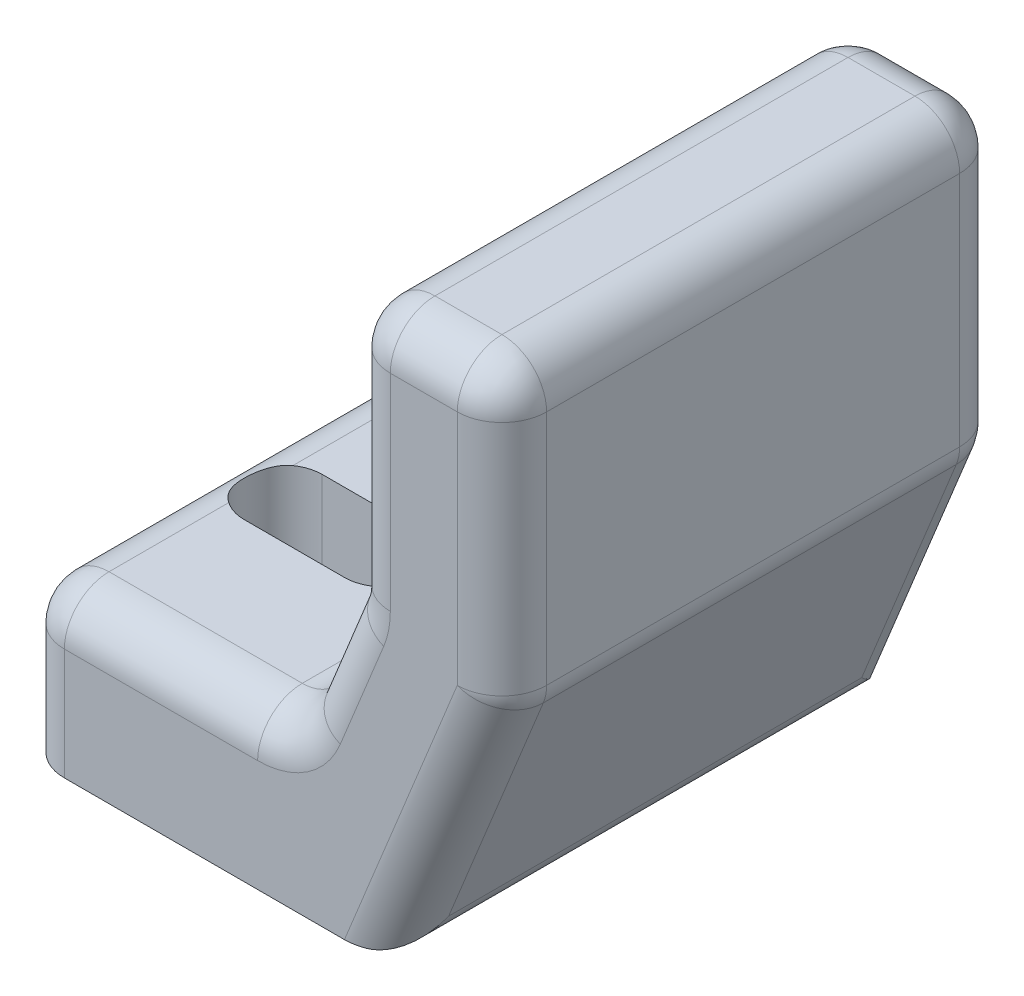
ISO-10303-21;
HEADER;
FILE_DESCRIPTION(('STEP AP214'),'2;1');
FILE_NAME('part.step','',(''),(''),'','','');
FILE_SCHEMA(('AUTOMOTIVE_DESIGN { 1 0 10303 214 1 1 1 1 }'));
ENDSEC;
DATA;
#1=APPLICATION_CONTEXT('core data for automotive mechanical design processes');
#2=APPLICATION_PROTOCOL_DEFINITION('international standard','automotive_design',2000,#1);
#3=PRODUCT_CONTEXT('',#1,'mechanical');
#4=PRODUCT('Part','Part','',(#3));
#5=PRODUCT_RELATED_PRODUCT_CATEGORY('part','',(#4));
#6=PRODUCT_DEFINITION_FORMATION('','',#4);
#7=PRODUCT_DEFINITION_CONTEXT('part definition',#1,'design');
#8=PRODUCT_DEFINITION('design','',#6,#7);
#9=PRODUCT_DEFINITION_SHAPE('','',#8);
#10=(LENGTH_UNIT() NAMED_UNIT(*) SI_UNIT(.MILLI.,.METRE.));
#11=(NAMED_UNIT(*) PLANE_ANGLE_UNIT() SI_UNIT($,.RADIAN.));
#12=(NAMED_UNIT(*) SI_UNIT($,.STERADIAN.) SOLID_ANGLE_UNIT());
#13=UNCERTAINTY_MEASURE_WITH_UNIT(LENGTH_MEASURE(1.E-05),#10,'distance_accuracy_value','');
#14=(GEOMETRIC_REPRESENTATION_CONTEXT(3) GLOBAL_UNCERTAINTY_ASSIGNED_CONTEXT((#13)) GLOBAL_UNIT_ASSIGNED_CONTEXT((#10,
#11,#12)) REPRESENTATION_CONTEXT('',''));
#15=CARTESIAN_POINT('',(0.,0.,0.));
#16=DIRECTION('',(0.,0.,1.));
#17=DIRECTION('',(1.,0.,0.));
#18=AXIS2_PLACEMENT_3D('',#15,#16,#17);
#19=CARTESIAN_POINT('',(0.,7.,22.5));
#20=DIRECTION('',(1.,0.,0.));
#21=DIRECTION('',(0.,1.,0.));
#22=AXIS2_PLACEMENT_3D('',#19,#20,#21);
#23=PLANE('',#22);
#24=DIRECTION('',(0.,0.,-1.));
#25=VECTOR('',#24,1.);
#26=CARTESIAN_POINT('',(0.,0.,22.5));
#27=LINE('',#26,#25);
#28=CARTESIAN_POINT('',(0.,0.,20.5));
#29=VERTEX_POINT('',#28);
#30=CARTESIAN_POINT('',(0.,0.,2.00000000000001));
#31=VERTEX_POINT('',#30);
#32=EDGE_CURVE('E295',#29,#31,#27,.T.);
#33=ORIENTED_EDGE('',*,*,#32,.F.);
#34=DIRECTION('',(0.,-1.,0.));
#35=VECTOR('',#34,1.);
#36=CARTESIAN_POINT('',(0.,7.,20.5));
#37=LINE('',#36,#35);
#38=CARTESIAN_POINT('',(0.,5.,20.5));
#39=VERTEX_POINT('',#38);
#40=EDGE_CURVE('E431',#29,#39,#37,.F.);
#41=ORIENTED_EDGE('',*,*,#40,.T.);
#42=DIRECTION('',(0.,0.,-1.));
#43=VECTOR('',#42,1.);
#44=CARTESIAN_POINT('',(0.,5.,22.5));
#45=LINE('',#44,#43);
#46=CARTESIAN_POINT('',(0.,5.,2.));
#47=VERTEX_POINT('',#46);
#48=EDGE_CURVE('E428',#39,#47,#45,.T.);
#49=ORIENTED_EDGE('',*,*,#48,.T.);
#50=DIRECTION('',(0.,-1.,0.));
#51=VECTOR('',#50,1.);
#52=CARTESIAN_POINT('',(0.,7.,2.));
#53=LINE('',#52,#51);
#54=EDGE_CURVE('E425',#47,#31,#53,.T.);
#55=ORIENTED_EDGE('',*,*,#54,.T.);
#56=EDGE_LOOP('',(#33,#41,#49,#55));
#57=FACE_BOUND('',#56,.T.);
#58=ADVANCED_FACE('F47',(#57),#23,.F.);
#59=CARTESIAN_POINT('',(0.,0.,22.5));
#60=DIRECTION('',(0.,1.,0.));
#61=DIRECTION('',(0.,0.,1.));
#62=AXIS2_PLACEMENT_3D('',#59,#60,#61);
#63=PLANE('',#62);
#64=DIRECTION('',(-1.,0.,0.));
#65=VECTOR('',#64,1.);
#66=CARTESIAN_POINT('',(3.,0.,11.95));
#67=LINE('',#66,#65);
#68=CARTESIAN_POINT('',(7.5,0.,11.95));
#69=VERTEX_POINT('',#68);
#70=CARTESIAN_POINT('',(3.,0.,11.95));
#71=VERTEX_POINT('',#70);
#72=EDGE_CURVE('E781',#69,#71,#67,.T.);
#73=ORIENTED_EDGE('',*,*,#72,.T.);
#74=CARTESIAN_POINT('',(3.,0.,13.7));
#75=DIRECTION('',(0.,1.,0.));
#76=DIRECTION('',(0.,0.,1.));
#77=AXIS2_PLACEMENT_3D('',#74,#75,#76);
#78=CIRCLE('',#77,1.75);
#79=CARTESIAN_POINT('',(3.,0.,15.45));
#80=VERTEX_POINT('',#79);
#81=EDGE_CURVE('E290',#80,#71,#78,.F.);
#82=ORIENTED_EDGE('',*,*,#81,.F.);
#83=DIRECTION('',(-1.,0.,0.));
#84=VECTOR('',#83,1.);
#85=CARTESIAN_POINT('',(3.,0.,15.45));
#86=LINE('',#85,#84);
#87=CARTESIAN_POINT('',(7.5,0.,15.45));
#88=VERTEX_POINT('',#87);
#89=EDGE_CURVE('E286',#88,#80,#86,.T.);
#90=ORIENTED_EDGE('',*,*,#89,.F.);
#91=CARTESIAN_POINT('',(7.5,0.,13.7));
#92=DIRECTION('',(0.,1.,0.));
#93=DIRECTION('',(0.,0.,1.));
#94=AXIS2_PLACEMENT_3D('',#91,#92,#93);
#95=CIRCLE('',#94,1.75);
#96=EDGE_CURVE('E252',#69,#88,#95,.F.);
#97=ORIENTED_EDGE('',*,*,#96,.F.);
#98=EDGE_LOOP('',(#73,#82,#90,#97));
#99=FACE_BOUND('',#98,.T.);
#100=DIRECTION('',(0.,0.,-1.));
#101=VECTOR('',#100,1.);
#102=CARTESIAN_POINT('',(15.3602325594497,0.,22.5));
#103=LINE('',#102,#101);
#104=CARTESIAN_POINT('',(15.3602325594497,0.,0.148181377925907));
#105=VERTEX_POINT('',#104);
#106=CARTESIAN_POINT('',(15.3602325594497,0.,22.3518186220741));
#107=VERTEX_POINT('',#106);
#108=EDGE_CURVE('E64',#105,#107,#103,.F.);
#109=ORIENTED_EDGE('',*,*,#108,.T.);
#110=CARTESIAN_POINT('',(14.5442868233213,0.,20.5));
#111=DIRECTION('',(0.,1.,0.));
#112=DIRECTION('',(-1.,0.,0.));
#113=AXIS2_PLACEMENT_3D('',#110,#111,#112);
#114=ELLIPSE('',#113,2.16003875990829,2.);
#115=CARTESIAN_POINT('',(14.5442868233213,0.,22.5));
#116=VERTEX_POINT('',#115);
#117=EDGE_CURVE('E11',#107,#116,#114,.F.);
#118=ORIENTED_EDGE('',*,*,#117,.T.);
#119=DIRECTION('',(1.,0.,0.));
#120=VECTOR('',#119,1.);
#121=CARTESIAN_POINT('',(0.,0.,22.5));
#122=LINE('',#121,#120);
#123=CARTESIAN_POINT('',(2.,0.,22.5));
#124=VERTEX_POINT('',#123);
#125=EDGE_CURVE('E291',#124,#116,#122,.T.);
#126=ORIENTED_EDGE('',*,*,#125,.F.);
#127=CARTESIAN_POINT('',(2.,0.,20.5));
#128=DIRECTION('',(0.,1.,0.));
#129=DIRECTION('',(0.,0.,1.));
#130=AXIS2_PLACEMENT_3D('',#127,#128,#129);
#131=CIRCLE('',#130,2.);
#132=EDGE_CURVE('E612',#124,#29,#131,.F.);
#133=ORIENTED_EDGE('',*,*,#132,.T.);
#134=ORIENTED_EDGE('',*,*,#32,.T.);
#135=CARTESIAN_POINT('',(2.,0.,2.));
#136=DIRECTION('',(0.,1.,0.));
#137=DIRECTION('',(0.,0.,1.));
#138=AXIS2_PLACEMENT_3D('',#135,#136,#137);
#139=CIRCLE('',#138,2.);
#140=CARTESIAN_POINT('',(2.,0.,0.));
#141=VERTEX_POINT('',#140);
#142=EDGE_CURVE('E459',#31,#141,#139,.F.);
#143=ORIENTED_EDGE('',*,*,#142,.T.);
#144=DIRECTION('',(1.,0.,0.));
#145=VECTOR('',#144,1.);
#146=CARTESIAN_POINT('',(0.,0.,0.));
#147=LINE('',#146,#145);
#148=CARTESIAN_POINT('',(14.5442868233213,0.,0.));
#149=VERTEX_POINT('',#148);
#150=EDGE_CURVE('E289',#141,#149,#147,.T.);
#151=ORIENTED_EDGE('',*,*,#150,.T.);
#152=CARTESIAN_POINT('',(14.5442868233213,0.,2.));
#153=DIRECTION('',(0.,1.,0.));
#154=DIRECTION('',(1.,0.,0.));
#155=AXIS2_PLACEMENT_3D('',#152,#153,#154);
#156=ELLIPSE('',#155,2.16003875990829,2.);
#157=EDGE_CURVE('E57',#149,#105,#156,.F.);
#158=ORIENTED_EDGE('',*,*,#157,.T.);
#159=EDGE_LOOP('',(#109,#118,#126,#133,#134,#143,#151,#158));
#160=FACE_BOUND('',#159,.T.);
#161=ADVANCED_FACE('F502',(#99,#160),#63,.F.);
#162=CARTESIAN_POINT('',(16.7043255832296,0.,22.5));
#163=DIRECTION('',(-0.925909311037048,0.377745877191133,0.));
#164=DIRECTION('',(-0.377745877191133,-0.925909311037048,0.));
#165=AXIS2_PLACEMENT_3D('',#162,#163,#164);
#166=PLANE('',#165);
#167=DIRECTION('',(0.377745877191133,0.925909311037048,0.));
#168=VECTOR('',#167,1.);
#169=CARTESIAN_POINT('',(16.7043255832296,0.,2.));
#170=LINE('',#169,#168);
#171=CARTESIAN_POINT('',(17.2120511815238,1.24450824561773,2.));
#172=VERTEX_POINT('',#171);
#173=CARTESIAN_POINT('',(21.4518186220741,11.6367861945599,2.));
#174=VERTEX_POINT('',#173);
#175=EDGE_CURVE('E402',#172,#174,#170,.T.);
#176=ORIENTED_EDGE('',*,*,#175,.T.);
#177=DIRECTION('',(0.,0.,-1.));
#178=VECTOR('',#177,1.);
#179=CARTESIAN_POINT('',(21.4518186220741,11.6367861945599,22.5));
#180=LINE('',#179,#178);
#181=CARTESIAN_POINT('',(21.4518186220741,11.6367861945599,20.5));
#182=VERTEX_POINT('',#181);
#183=EDGE_CURVE('E408',#174,#182,#180,.F.);
#184=ORIENTED_EDGE('',*,*,#183,.T.);
#185=DIRECTION('',(0.377745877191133,0.925909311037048,0.));
#186=VECTOR('',#185,1.);
#187=CARTESIAN_POINT('',(16.7043255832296,0.,20.5));
#188=LINE('',#187,#186);
#189=CARTESIAN_POINT('',(17.2120511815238,1.24450824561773,20.5));
#190=VERTEX_POINT('',#189);
#191=EDGE_CURVE('E405',#182,#190,#188,.F.);
#192=ORIENTED_EDGE('',*,*,#191,.T.);
#193=DIRECTION('',(0.,0.,-1.));
#194=VECTOR('',#193,1.);
#195=CARTESIAN_POINT('',(17.2120511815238,1.24450824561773,22.5));
#196=LINE('',#195,#194);
#197=EDGE_CURVE('E399',#190,#172,#196,.T.);
#198=ORIENTED_EDGE('',*,*,#197,.T.);
#199=EDGE_LOOP('',(#176,#184,#192,#198));
#200=FACE_BOUND('',#199,.T.);
#201=ADVANCED_FACE('F498',(#200),#166,.F.);
#202=CARTESIAN_POINT('',(21.6,12.,22.5));
#203=DIRECTION('',(-1.,0.,0.));
#204=DIRECTION('',(0.,0.,1.));
#205=AXIS2_PLACEMENT_3D('',#202,#203,#204);
#206=PLANE('',#205);
#207=DIRECTION('',(0.,1.,0.));
#208=VECTOR('',#207,1.);
#209=CARTESIAN_POINT('',(21.6,12.,20.5));
#210=LINE('',#209,#208);
#211=CARTESIAN_POINT('',(21.6,23.,20.5));
#212=VERTEX_POINT('',#211);
#213=CARTESIAN_POINT('',(21.6,12.3922779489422,20.5));
#214=VERTEX_POINT('',#213);
#215=EDGE_CURVE('E392',#212,#214,#210,.F.);
#216=ORIENTED_EDGE('',*,*,#215,.T.);
#217=DIRECTION('',(0.,0.,-1.));
#218=VECTOR('',#217,1.);
#219=CARTESIAN_POINT('',(21.6,12.3922779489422,22.5));
#220=LINE('',#219,#218);
#221=CARTESIAN_POINT('',(21.6,12.3922779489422,2.));
#222=VERTEX_POINT('',#221);
#223=EDGE_CURVE('E395',#214,#222,#220,.T.);
#224=ORIENTED_EDGE('',*,*,#223,.T.);
#225=DIRECTION('',(0.,1.,0.));
#226=VECTOR('',#225,1.);
#227=CARTESIAN_POINT('',(21.6,12.,2.));
#228=LINE('',#227,#226);
#229=CARTESIAN_POINT('',(21.6,23.,2.));
#230=VERTEX_POINT('',#229);
#231=EDGE_CURVE('E386',#222,#230,#228,.T.);
#232=ORIENTED_EDGE('',*,*,#231,.T.);
#233=DIRECTION('',(0.,0.,-1.));
#234=VECTOR('',#233,1.);
#235=CARTESIAN_POINT('',(21.6,23.,22.5));
#236=LINE('',#235,#234);
#237=EDGE_CURVE('E389',#230,#212,#236,.F.);
#238=ORIENTED_EDGE('',*,*,#237,.T.);
#239=EDGE_LOOP('',(#216,#224,#232,#238));
#240=FACE_BOUND('',#239,.T.);
#241=ADVANCED_FACE('F494',(#240),#206,.F.);
#242=CARTESIAN_POINT('',(21.6,25.,22.5));
#243=DIRECTION('',(0.,-1.,0.));
#244=DIRECTION('',(0.,0.,-1.));
#245=AXIS2_PLACEMENT_3D('',#242,#243,#244);
#246=PLANE('',#245);
#247=DIRECTION('',(-1.,0.,0.));
#248=VECTOR('',#247,1.);
#249=CARTESIAN_POINT('',(21.6,25.,20.5));
#250=LINE('',#249,#248);
#251=CARTESIAN_POINT('',(16.6,25.,20.5));
#252=VERTEX_POINT('',#251);
#253=CARTESIAN_POINT('',(19.6,25.,20.5));
#254=VERTEX_POINT('',#253);
#255=EDGE_CURVE('E418',#252,#254,#250,.F.);
#256=ORIENTED_EDGE('',*,*,#255,.T.);
#257=DIRECTION('',(0.,0.,-1.));
#258=VECTOR('',#257,1.);
#259=CARTESIAN_POINT('',(19.6,25.,22.5));
#260=LINE('',#259,#258);
#261=CARTESIAN_POINT('',(19.6,25.,2.));
#262=VERTEX_POINT('',#261);
#263=EDGE_CURVE('E421',#254,#262,#260,.T.);
#264=ORIENTED_EDGE('',*,*,#263,.T.);
#265=DIRECTION('',(-1.,0.,0.));
#266=VECTOR('',#265,1.);
#267=CARTESIAN_POINT('',(21.6,25.,2.));
#268=LINE('',#267,#266);
#269=CARTESIAN_POINT('',(16.6,25.,2.));
#270=VERTEX_POINT('',#269);
#271=EDGE_CURVE('E415',#262,#270,#268,.T.);
#272=ORIENTED_EDGE('',*,*,#271,.T.);
#273=DIRECTION('',(0.,0.,-1.));
#274=VECTOR('',#273,1.);
#275=CARTESIAN_POINT('',(16.6,25.,22.5));
#276=LINE('',#275,#274);
#277=EDGE_CURVE('E412',#270,#252,#276,.F.);
#278=ORIENTED_EDGE('',*,*,#277,.T.);
#279=EDGE_LOOP('',(#256,#264,#272,#278));
#280=FACE_BOUND('',#279,.T.);
#281=ADVANCED_FACE('F490',(#280),#246,.F.);
#282=CARTESIAN_POINT('',(14.6,25.,22.5));
#283=DIRECTION('',(1.,0.,0.));
#284=DIRECTION('',(0.,1.,0.));
#285=AXIS2_PLACEMENT_3D('',#282,#283,#284);
#286=PLANE('',#285);
#287=DIRECTION('',(0.,-1.,0.));
#288=VECTOR('',#287,1.);
#289=CARTESIAN_POINT('',(14.6,25.,20.5));
#290=LINE('',#289,#288);
#291=CARTESIAN_POINT('',(14.6,13.7652507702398,20.5));
#292=VERTEX_POINT('',#291);
#293=CARTESIAN_POINT('',(14.6,23.,20.5));
#294=VERTEX_POINT('',#293);
#295=EDGE_CURVE('E304',#292,#294,#290,.F.);
#296=ORIENTED_EDGE('',*,*,#295,.T.);
#297=DIRECTION('',(0.,0.,-1.));
#298=VECTOR('',#297,1.);
#299=CARTESIAN_POINT('',(14.6,23.,22.5));
#300=LINE('',#299,#298);
#301=CARTESIAN_POINT('',(14.6,23.,2.));
#302=VERTEX_POINT('',#301);
#303=EDGE_CURVE('E311',#294,#302,#300,.T.);
#304=ORIENTED_EDGE('',*,*,#303,.T.);
#305=DIRECTION('',(0.,-1.,0.));
#306=VECTOR('',#305,1.);
#307=CARTESIAN_POINT('',(14.6,25.,2.));
#308=LINE('',#307,#306);
#309=CARTESIAN_POINT('',(14.6,13.7652507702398,2.));
#310=VERTEX_POINT('',#309);
#311=EDGE_CURVE('E307',#302,#310,#308,.T.);
#312=ORIENTED_EDGE('',*,*,#311,.T.);
#313=DIRECTION('',(0.,0.,-1.));
#314=VECTOR('',#313,1.);
#315=CARTESIAN_POINT('',(14.6,13.7652507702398,22.5));
#316=LINE('',#315,#314);
#317=EDGE_CURVE('E301',#310,#292,#316,.F.);
#318=ORIENTED_EDGE('',*,*,#317,.T.);
#319=EDGE_LOOP('',(#296,#304,#312,#318));
#320=FACE_BOUND('',#319,.T.);
#321=ADVANCED_FACE('F486',(#320),#286,.F.);
#322=CARTESIAN_POINT('',(14.6,13.3729728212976,22.5));
#323=DIRECTION('',(0.925909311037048,-0.377745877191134,0.));
#324=DIRECTION('',(0.377745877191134,0.925909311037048,0.));
#325=AXIS2_PLACEMENT_3D('',#322,#323,#324);
#326=PLANE('',#325);
#327=DIRECTION('',(-0.377745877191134,-0.925909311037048,0.));
#328=VECTOR('',#327,1.);
#329=CARTESIAN_POINT('',(14.6,13.3729728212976,20.5));
#330=LINE('',#329,#328);
#331=CARTESIAN_POINT('',(12.5077255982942,8.24450824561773,20.5));
#332=VERTEX_POINT('',#331);
#333=CARTESIAN_POINT('',(14.4518186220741,13.0097590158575,20.5));
#334=VERTEX_POINT('',#333);
#335=EDGE_CURVE('E376',#332,#334,#330,.F.);
#336=ORIENTED_EDGE('',*,*,#335,.T.);
#337=DIRECTION('',(0.,0.,-1.));
#338=VECTOR('',#337,1.);
#339=CARTESIAN_POINT('',(14.4518186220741,13.0097590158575,0.));
#340=LINE('',#339,#338);
#341=CARTESIAN_POINT('',(14.4518186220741,13.0097590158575,2.));
#342=VERTEX_POINT('',#341);
#343=EDGE_CURVE('E383',#334,#342,#340,.T.);
#344=ORIENTED_EDGE('',*,*,#343,.T.);
#345=DIRECTION('',(-0.377745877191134,-0.925909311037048,0.));
#346=VECTOR('',#345,1.);
#347=CARTESIAN_POINT('',(14.6,13.3729728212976,2.));
#348=LINE('',#347,#346);
#349=CARTESIAN_POINT('',(12.5077255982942,8.24450824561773,2.));
#350=VERTEX_POINT('',#349);
#351=EDGE_CURVE('E379',#342,#350,#348,.T.);
#352=ORIENTED_EDGE('',*,*,#351,.T.);
#353=DIRECTION('',(0.,0.,-1.));
#354=VECTOR('',#353,1.);
#355=CARTESIAN_POINT('',(12.5077255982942,8.24450824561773,22.5));
#356=LINE('',#355,#354);
#357=EDGE_CURVE('E373',#350,#332,#356,.F.);
#358=ORIENTED_EDGE('',*,*,#357,.T.);
#359=EDGE_LOOP('',(#336,#344,#352,#358));
#360=FACE_BOUND('',#359,.T.);
#361=ADVANCED_FACE('F483',(#360),#326,.F.);
#362=CARTESIAN_POINT('',(12.,7.,22.5));
#363=DIRECTION('',(0.,-1.,0.));
#364=DIRECTION('',(1.,0.,0.));
#365=AXIS2_PLACEMENT_3D('',#362,#363,#364);
#366=PLANE('',#365);
#367=DIRECTION('',(-1.,0.,0.));
#368=VECTOR('',#367,1.);
#369=CARTESIAN_POINT('',(12.,7.,2.));
#370=LINE('',#369,#368);
#371=CARTESIAN_POINT('',(10.6559069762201,7.,2.));
#372=VERTEX_POINT('',#371);
#373=CARTESIAN_POINT('',(2.,7.,2.));
#374=VERTEX_POINT('',#373);
#375=EDGE_CURVE('E440',#372,#374,#370,.T.);
#376=ORIENTED_EDGE('',*,*,#375,.T.);
#377=DIRECTION('',(0.,0.,-1.));
#378=VECTOR('',#377,1.);
#379=CARTESIAN_POINT('',(2.,7.,22.5));
#380=LINE('',#379,#378);
#381=CARTESIAN_POINT('',(2.,7.,12.2638593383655));
#382=VERTEX_POINT('',#381);
#383=EDGE_CURVE('E446',#374,#382,#380,.F.);
#384=ORIENTED_EDGE('',*,*,#383,.T.);
#385=CARTESIAN_POINT('',(3.,7.,13.7));
#386=DIRECTION('',(0.,1.,0.));
#387=DIRECTION('',(-1.,0.,0.));
#388=AXIS2_PLACEMENT_3D('',#385,#386,#387);
#389=CIRCLE('',#388,1.75);
#390=CARTESIAN_POINT('',(3.,7.,11.95));
#391=VERTEX_POINT('',#390);
#392=EDGE_CURVE('E267',#391,#382,#389,.T.);
#393=ORIENTED_EDGE('',*,*,#392,.F.);
#394=DIRECTION('',(1.,0.,0.));
#395=VECTOR('',#394,1.);
#396=CARTESIAN_POINT('',(3.,7.,11.95));
#397=LINE('',#396,#395);
#398=CARTESIAN_POINT('',(7.5,7.,11.95));
#399=VERTEX_POINT('',#398);
#400=EDGE_CURVE('E272',#391,#399,#397,.T.);
#401=ORIENTED_EDGE('',*,*,#400,.T.);
#402=CARTESIAN_POINT('',(7.5,7.,13.7));
#403=DIRECTION('',(0.,1.,0.));
#404=DIRECTION('',(-1.,0.,0.));
#405=AXIS2_PLACEMENT_3D('',#402,#403,#404);
#406=CIRCLE('',#405,1.75);
#407=CARTESIAN_POINT('',(7.5,7.,15.45));
#408=VERTEX_POINT('',#407);
#409=EDGE_CURVE('E249',#408,#399,#406,.T.);
#410=ORIENTED_EDGE('',*,*,#409,.F.);
#411=DIRECTION('',(1.,0.,0.));
#412=VECTOR('',#411,1.);
#413=CARTESIAN_POINT('',(3.,7.,15.45));
#414=LINE('',#413,#412);
#415=CARTESIAN_POINT('',(3.,7.,15.45));
#416=VERTEX_POINT('',#415);
#417=EDGE_CURVE('E261',#416,#408,#414,.T.);
#418=ORIENTED_EDGE('',*,*,#417,.F.);
#419=CARTESIAN_POINT('',(2.,7.,15.1361406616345));
#420=VERTEX_POINT('',#419);
#421=EDGE_CURVE('E771',#420,#416,#389,.T.);
#422=ORIENTED_EDGE('',*,*,#421,.F.);
#423=DIRECTION('',(0.,0.,-1.));
#424=VECTOR('',#423,1.);
#425=CARTESIAN_POINT('',(2.,7.,22.5));
#426=LINE('',#425,#424);
#427=CARTESIAN_POINT('',(2.,7.,20.5));
#428=VERTEX_POINT('',#427);
#429=EDGE_CURVE('E443',#420,#428,#426,.F.);
#430=ORIENTED_EDGE('',*,*,#429,.T.);
#431=DIRECTION('',(-1.,0.,0.));
#432=VECTOR('',#431,1.);
#433=CARTESIAN_POINT('',(12.,7.,20.5));
#434=LINE('',#433,#432);
#435=CARTESIAN_POINT('',(10.6559069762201,7.,20.5));
#436=VERTEX_POINT('',#435);
#437=EDGE_CURVE('E437',#428,#436,#434,.F.);
#438=ORIENTED_EDGE('',*,*,#437,.T.);
#439=DIRECTION('',(0.,0.,-1.));
#440=VECTOR('',#439,1.);
#441=CARTESIAN_POINT('',(10.6559069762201,7.,0.));
#442=LINE('',#441,#440);
#443=EDGE_CURVE('E434',#436,#372,#442,.T.);
#444=ORIENTED_EDGE('',*,*,#443,.T.);
#445=EDGE_LOOP('',(#376,#384,#393,#401,#410,#418,#422,#430,#438,#444));
#446=FACE_BOUND('',#445,.T.);
#447=ADVANCED_FACE('F269',(#446),#366,.F.);
#448=CARTESIAN_POINT('',(0.,0.,22.5));
#449=DIRECTION('',(0.,0.,1.));
#450=DIRECTION('',(1.,0.,0.));
#451=AXIS2_PLACEMENT_3D('',#448,#449,#450);
#452=PLANE('',#451);
#453=ORIENTED_EDGE('',*,*,#125,.T.);
#454=DIRECTION('',(0.377745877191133,0.925909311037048,0.));
#455=VECTOR('',#454,1.);
#456=CARTESIAN_POINT('',(19.7481813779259,12.7554917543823,22.5));
#457=LINE('',#456,#455);
#458=CARTESIAN_POINT('',(19.6,12.3922779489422,22.5));
#459=VERTEX_POINT('',#458);
#460=EDGE_CURVE('E370',#116,#459,#457,.T.);
#461=ORIENTED_EDGE('',*,*,#460,.T.);
#462=DIRECTION('',(0.,1.,0.));
#463=VECTOR('',#462,1.);
#464=CARTESIAN_POINT('',(19.6,25.,22.5));
#465=LINE('',#464,#463);
#466=CARTESIAN_POINT('',(19.6,23.,22.5));
#467=VERTEX_POINT('',#466);
#468=EDGE_CURVE('E367',#459,#467,#465,.T.);
#469=ORIENTED_EDGE('',*,*,#468,.T.);
#470=DIRECTION('',(-1.,0.,0.));
#471=VECTOR('',#470,1.);
#472=CARTESIAN_POINT('',(14.6,23.,22.5));
#473=LINE('',#472,#471);
#474=CARTESIAN_POINT('',(16.6,23.,22.5));
#475=VERTEX_POINT('',#474);
#476=EDGE_CURVE('E364',#467,#475,#473,.T.);
#477=ORIENTED_EDGE('',*,*,#476,.T.);
#478=DIRECTION('',(0.,-1.,0.));
#479=VECTOR('',#478,1.);
#480=CARTESIAN_POINT('',(16.6,13.3729728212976,22.5));
#481=LINE('',#480,#479);
#482=CARTESIAN_POINT('',(16.6,13.7652507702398,22.5));
#483=VERTEX_POINT('',#482);
#484=EDGE_CURVE('E361',#475,#483,#481,.T.);
#485=ORIENTED_EDGE('',*,*,#484,.T.);
#486=CARTESIAN_POINT('',(12.6,13.7652507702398,22.5));
#487=DIRECTION('',(0.,0.,1.));
#488=DIRECTION('',(1.,0.,0.));
#489=AXIS2_PLACEMENT_3D('',#486,#487,#488);
#490=CIRCLE('',#489,4.);
#491=CARTESIAN_POINT('',(16.3036372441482,12.2542672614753,22.5));
#492=VERTEX_POINT('',#491);
#493=EDGE_CURVE('E357',#492,#483,#490,.T.);
#494=ORIENTED_EDGE('',*,*,#493,.F.);
#495=DIRECTION('',(-0.377745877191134,-0.925909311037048,0.));
#496=VECTOR('',#495,1.);
#497=CARTESIAN_POINT('',(13.8518186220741,6.24450824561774,22.5));
#498=LINE('',#497,#496);
#499=CARTESIAN_POINT('',(14.3595442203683,7.48901649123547,22.5));
#500=VERTEX_POINT('',#499);
#501=EDGE_CURVE('E354',#492,#500,#498,.T.);
#502=ORIENTED_EDGE('',*,*,#501,.T.);
#503=CARTESIAN_POINT('',(10.6559069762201,9.,22.5));
#504=DIRECTION('',(0.,0.,1.));
#505=DIRECTION('',(1.,0.,0.));
#506=AXIS2_PLACEMENT_3D('',#503,#504,#505);
#507=CIRCLE('',#506,4.);
#508=CARTESIAN_POINT('',(10.6559069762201,5.,22.5));
#509=VERTEX_POINT('',#508);
#510=EDGE_CURVE('E350',#509,#500,#507,.T.);
#511=ORIENTED_EDGE('',*,*,#510,.F.);
#512=DIRECTION('',(-1.,0.,0.));
#513=VECTOR('',#512,1.);
#514=CARTESIAN_POINT('',(0.,5.,22.5));
#515=LINE('',#514,#513);
#516=CARTESIAN_POINT('',(2.,5.,22.5));
#517=VERTEX_POINT('',#516);
#518=EDGE_CURVE('E347',#509,#517,#515,.T.);
#519=ORIENTED_EDGE('',*,*,#518,.T.);
#520=DIRECTION('',(0.,-1.,0.));
#521=VECTOR('',#520,1.);
#522=CARTESIAN_POINT('',(2.,0.,22.5));
#523=LINE('',#522,#521);
#524=EDGE_CURVE('E344',#517,#124,#523,.T.);
#525=ORIENTED_EDGE('',*,*,#524,.T.);
#526=EDGE_LOOP('',(#453,#461,#469,#477,#485,#494,#502,#511,#519,#525));
#527=FACE_BOUND('',#526,.T.);
#528=ADVANCED_FACE('F474',(#527),#452,.T.);
#529=CARTESIAN_POINT('',(0.,0.,0.));
#530=DIRECTION('',(0.,0.,1.));
#531=DIRECTION('',(1.,0.,0.));
#532=AXIS2_PLACEMENT_3D('',#529,#530,#531);
#533=PLANE('',#532);
#534=DIRECTION('',(0.,1.,0.));
#535=VECTOR('',#534,1.);
#536=CARTESIAN_POINT('',(19.6,0.,0.));
#537=LINE('',#536,#535);
#538=CARTESIAN_POINT('',(19.6,23.,0.));
#539=VERTEX_POINT('',#538);
#540=CARTESIAN_POINT('',(19.6,12.3922779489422,0.));
#541=VERTEX_POINT('',#540);
#542=EDGE_CURVE('E338',#539,#541,#537,.F.);
#543=ORIENTED_EDGE('',*,*,#542,.T.);
#544=DIRECTION('',(0.377745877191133,0.925909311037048,0.));
#545=VECTOR('',#544,1.);
#546=CARTESIAN_POINT('',(12.4689342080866,-5.0869868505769,0.));
#547=LINE('',#546,#545);
#548=EDGE_CURVE('E341',#541,#149,#547,.F.);
#549=ORIENTED_EDGE('',*,*,#548,.T.);
#550=ORIENTED_EDGE('',*,*,#150,.F.);
#551=DIRECTION('',(0.,-1.,0.));
#552=VECTOR('',#551,1.);
#553=CARTESIAN_POINT('',(2.,0.,0.));
#554=LINE('',#553,#552);
#555=CARTESIAN_POINT('',(2.,5.,0.));
#556=VERTEX_POINT('',#555);
#557=EDGE_CURVE('E314',#141,#556,#554,.F.);
#558=ORIENTED_EDGE('',*,*,#557,.T.);
#559=DIRECTION('',(-1.,0.,0.));
#560=VECTOR('',#559,1.);
#561=CARTESIAN_POINT('',(0.,5.,0.));
#562=LINE('',#561,#560);
#563=CARTESIAN_POINT('',(10.6559069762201,5.,0.));
#564=VERTEX_POINT('',#563);
#565=EDGE_CURVE('E317',#556,#564,#562,.F.);
#566=ORIENTED_EDGE('',*,*,#565,.T.);
#567=CARTESIAN_POINT('',(10.6559069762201,9.,0.));
#568=DIRECTION('',(0.,0.,1.));
#569=DIRECTION('',(1.,0.,0.));
#570=AXIS2_PLACEMENT_3D('',#567,#568,#569);
#571=CIRCLE('',#570,4.);
#572=CARTESIAN_POINT('',(14.3595442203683,7.48901649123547,0.));
#573=VERTEX_POINT('',#572);
#574=EDGE_CURVE('E320',#573,#564,#571,.F.);
#575=ORIENTED_EDGE('',*,*,#574,.F.);
#576=DIRECTION('',(-0.377745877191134,-0.925909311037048,0.));
#577=VECTOR('',#576,1.);
#578=CARTESIAN_POINT('',(9.69120627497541,-3.95374921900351,0.));
#579=LINE('',#578,#577);
#580=CARTESIAN_POINT('',(16.3036372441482,12.2542672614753,0.));
#581=VERTEX_POINT('',#580);
#582=EDGE_CURVE('E324',#573,#581,#579,.F.);
#583=ORIENTED_EDGE('',*,*,#582,.T.);
#584=CARTESIAN_POINT('',(12.6,13.7652507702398,0.));
#585=DIRECTION('',(0.,0.,1.));
#586=DIRECTION('',(1.,0.,0.));
#587=AXIS2_PLACEMENT_3D('',#584,#585,#586);
#588=CIRCLE('',#587,4.);
#589=CARTESIAN_POINT('',(16.6,13.7652507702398,0.));
#590=VERTEX_POINT('',#589);
#591=EDGE_CURVE('E327',#590,#581,#588,.F.);
#592=ORIENTED_EDGE('',*,*,#591,.F.);
#593=DIRECTION('',(0.,-1.,0.));
#594=VECTOR('',#593,1.);
#595=CARTESIAN_POINT('',(16.6,0.,0.));
#596=LINE('',#595,#594);
#597=CARTESIAN_POINT('',(16.6,23.,0.));
#598=VERTEX_POINT('',#597);
#599=EDGE_CURVE('E331',#590,#598,#596,.F.);
#600=ORIENTED_EDGE('',*,*,#599,.T.);
#601=DIRECTION('',(-1.,0.,0.));
#602=VECTOR('',#601,1.);
#603=CARTESIAN_POINT('',(0.,23.,0.));
#604=LINE('',#603,#602);
#605=EDGE_CURVE('E335',#598,#539,#604,.F.);
#606=ORIENTED_EDGE('',*,*,#605,.T.);
#607=EDGE_LOOP('',(#543,#549,#550,#558,#566,#575,#583,#592,#600,#606));
#608=FACE_BOUND('',#607,.T.);
#609=ADVANCED_FACE('F471',(#608),#533,.F.);
#610=CARTESIAN_POINT('',(3.,-8.73212459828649,13.7));
#611=DIRECTION('',(0.,1.,0.));
#612=DIRECTION('',(-1.,0.,0.));
#613=AXIS2_PLACEMENT_3D('',#610,#611,#612);
#614=CYLINDRICAL_SURFACE('',#613,1.75);
#615=ORIENTED_EDGE('',*,*,#392,.T.);
#616=CARTESIAN_POINT('',(2.,7.,12.2638593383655));
#617=CARTESIAN_POINT('',(1.96058986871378,7.00000165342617,12.2912974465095));
#618=CARTESIAN_POINT('',(1.92234705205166,6.99883513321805,12.3203393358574));
#619=CARTESIAN_POINT('',(1.84846522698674,6.99459359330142,12.3813793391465));
#620=CARTESIAN_POINT('',(1.81282391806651,6.9915202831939,12.4133747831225));
#621=CARTESIAN_POINT('',(1.71033841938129,6.98010338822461,12.5132632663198));
#622=CARTESIAN_POINT('',(1.64765803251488,6.96955694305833,12.5852506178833));
#623=CARTESIAN_POINT('',(1.53513314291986,6.94607451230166,12.7378925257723));
#624=CARTESIAN_POINT('',(1.48525559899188,6.93314482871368,12.8185239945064));
#625=CARTESIAN_POINT('',(1.39906275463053,6.90811205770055,12.9869453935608));
#626=CARTESIAN_POINT('',(1.36275622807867,6.8960095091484,13.0747399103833));
#627=CARTESIAN_POINT('',(1.30340477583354,6.87504828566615,13.2596448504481));
#628=CARTESIAN_POINT('',(1.28104542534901,6.8663641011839,13.356997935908));
#629=CARTESIAN_POINT('',(1.2532270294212,6.85541541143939,13.5543993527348));
#630=CARTESIAN_POINT('',(1.24775320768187,6.85314529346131,13.6544452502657));
#631=CARTESIAN_POINT('',(1.25371872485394,6.85554925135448,13.8472603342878));
#632=CARTESIAN_POINT('',(1.26405939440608,6.85977233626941,13.9400716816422));
#633=CARTESIAN_POINT('',(1.29923791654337,6.87330754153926,14.1225553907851));
#634=CARTESIAN_POINT('',(1.32408575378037,6.88262316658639,14.2122255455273));
#635=CARTESIAN_POINT('',(1.38769202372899,6.90425990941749,14.3867719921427));
#636=CARTESIAN_POINT('',(1.42654439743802,6.9166011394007,14.4716113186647));
#637=CARTESIAN_POINT('',(1.51715685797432,6.94140779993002,14.6339788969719));
#638=CARTESIAN_POINT('',(1.56890717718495,6.9538731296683,14.7115126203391));
#639=CARTESIAN_POINT('',(1.6795273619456,6.97488939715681,14.8515754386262));
#640=CARTESIAN_POINT('',(1.73744277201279,6.98368017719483,14.9148167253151));
#641=CARTESIAN_POINT('',(1.83103154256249,6.99309738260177,15.0030197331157));
#642=CARTESIAN_POINT('',(1.86339532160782,6.99560912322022,15.0313446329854));
#643=CARTESIAN_POINT('',(1.93019316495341,6.99906161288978,15.0855926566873));
#644=CARTESIAN_POINT('',(1.96462874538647,7.0000011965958,15.111513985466));
#645=CARTESIAN_POINT('',(2.,7.,15.1361406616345));
#646=B_SPLINE_CURVE_WITH_KNOTS('',3,(#616,#617,#618,#619,#620,#621,#622,#623,#624,#625,#626,
#627,#628,#629,#630,#631,#632,#633,#634,#635,#636,#637,#638,#639,#640,#641,#642,#643,#644,#645),
.UNSPECIFIED.,.F.,.F.,(4,2,2,2,2,2,2,2,2,2,2,2,2,2,4),(0.,0.143936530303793,0.287744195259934,
0.574368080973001,0.860244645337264,1.14630571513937,1.44550348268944,1.74443935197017,
2.02353013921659,2.3028132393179,2.58400571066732,2.86498587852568,3.12251922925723,
3.25163497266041,3.38084637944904),.UNSPECIFIED.);
#647=EDGE_CURVE('E450',#382,#420,#646,.T.);
#648=ORIENTED_EDGE('',*,*,#647,.T.);
#649=ORIENTED_EDGE('',*,*,#421,.T.);
#650=DIRECTION('',(0.,1.,0.));
#651=VECTOR('',#650,1.);
#652=CARTESIAN_POINT('',(3.,-8.73212459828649,15.45));
#653=LINE('',#652,#651);
#654=EDGE_CURVE('E257',#80,#416,#653,.T.);
#655=ORIENTED_EDGE('',*,*,#654,.F.);
#656=ORIENTED_EDGE('',*,*,#81,.T.);
#657=DIRECTION('',(0.,1.,0.));
#658=VECTOR('',#657,1.);
#659=CARTESIAN_POINT('',(3.,-8.73212459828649,11.95));
#660=LINE('',#659,#658);
#661=EDGE_CURVE('E279',#71,#391,#660,.T.);
#662=ORIENTED_EDGE('',*,*,#661,.T.);
#663=EDGE_LOOP('',(#615,#648,#649,#655,#656,#662));
#664=FACE_BOUND('',#663,.T.);
#665=ADVANCED_FACE('F465',(#664),#614,.F.);
#666=CARTESIAN_POINT('',(3.,-8.73212459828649,11.95));
#667=DIRECTION('',(0.,0.,1.));
#668=DIRECTION('',(1.,0.,0.));
#669=AXIS2_PLACEMENT_3D('',#666,#667,#668);
#670=PLANE('',#669);
#671=DIRECTION('',(0.,1.,0.));
#672=VECTOR('',#671,1.);
#673=CARTESIAN_POINT('',(7.5,-8.73212459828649,11.95));
#674=LINE('',#673,#672);
#675=EDGE_CURVE('E256',#69,#399,#674,.T.);
#676=ORIENTED_EDGE('',*,*,#675,.T.);
#677=ORIENTED_EDGE('',*,*,#400,.F.);
#678=ORIENTED_EDGE('',*,*,#661,.F.);
#679=ORIENTED_EDGE('',*,*,#72,.F.);
#680=EDGE_LOOP('',(#676,#677,#678,#679));
#681=FACE_BOUND('',#680,.T.);
#682=ADVANCED_FACE('F470',(#681),#670,.T.);
#683=CARTESIAN_POINT('',(7.5,-8.73212459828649,13.7));
#684=DIRECTION('',(0.,1.,0.));
#685=DIRECTION('',(-1.,0.,0.));
#686=AXIS2_PLACEMENT_3D('',#683,#684,#685);
#687=CYLINDRICAL_SURFACE('',#686,1.75);
#688=ORIENTED_EDGE('',*,*,#96,.T.);
#689=DIRECTION('',(0.,1.,0.));
#690=VECTOR('',#689,1.);
#691=CARTESIAN_POINT('',(7.5,-8.73212459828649,15.45));
#692=LINE('',#691,#690);
#693=EDGE_CURVE('E244',#88,#408,#692,.T.);
#694=ORIENTED_EDGE('',*,*,#693,.T.);
#695=ORIENTED_EDGE('',*,*,#409,.T.);
#696=ORIENTED_EDGE('',*,*,#675,.F.);
#697=EDGE_LOOP('',(#688,#694,#695,#696));
#698=FACE_BOUND('',#697,.T.);
#699=ADVANCED_FACE('F246',(#698),#687,.F.);
#700=CARTESIAN_POINT('',(3.,-8.73212459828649,15.45));
#701=DIRECTION('',(0.,0.,1.));
#702=DIRECTION('',(1.,0.,0.));
#703=AXIS2_PLACEMENT_3D('',#700,#701,#702);
#704=PLANE('',#703);
#705=ORIENTED_EDGE('',*,*,#89,.T.);
#706=ORIENTED_EDGE('',*,*,#654,.T.);
#707=ORIENTED_EDGE('',*,*,#417,.T.);
#708=ORIENTED_EDGE('',*,*,#693,.F.);
#709=EDGE_LOOP('',(#705,#706,#707,#708));
#710=FACE_BOUND('',#709,.T.);
#711=ADVANCED_FACE('F262',(#710),#704,.F.);
#712=CARTESIAN_POINT('',(12.4689342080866,-5.0869868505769,20.5));
#713=DIRECTION('',(-0.377745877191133,-0.925909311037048,0.));
#714=DIRECTION('',(0.925909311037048,-0.377745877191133,0.));
#715=AXIS2_PLACEMENT_3D('',#712,#713,#714);
#716=CYLINDRICAL_SURFACE('',#715,2.);
#717=ORIENTED_EDGE('',*,*,#460,.F.);
#718=ORIENTED_EDGE('',*,*,#117,.F.);
#719=CARTESIAN_POINT('',(15.3602325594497,2.,20.5));
#720=DIRECTION('',(-0.267106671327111,-0.654716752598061,-0.707106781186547));
#721=DIRECTION('',(0.267106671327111,0.654716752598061,-0.707106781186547));
#722=AXIS2_PLACEMENT_3D('',#719,#720,#721);
#723=ELLIPSE('',#722,2.82842712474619,2.);
#724=EDGE_CURVE('E51',#190,#107,#723,.T.);
#725=ORIENTED_EDGE('',*,*,#724,.F.);
#726=ORIENTED_EDGE('',*,*,#191,.F.);
#727=CARTESIAN_POINT('',(19.6,12.3922779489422,20.5));
#728=DIRECTION('',(0.377745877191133,0.925909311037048,0.));
#729=DIRECTION('',(-0.925909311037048,0.377745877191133,0.));
#730=AXIS2_PLACEMENT_3D('',#727,#728,#729);
#731=CIRCLE('',#730,2.);
#732=EDGE_CURVE('E761',#459,#182,#731,.T.);
#733=ORIENTED_EDGE('',*,*,#732,.F.);
#734=EDGE_LOOP('',(#717,#718,#725,#726,#733));
#735=FACE_BOUND('',#734,.T.);
#736=ADVANCED_FACE('F49',(#735),#716,.T.);
#737=CARTESIAN_POINT('',(2.,0.,20.5));
#738=DIRECTION('',(0.,1.,0.));
#739=DIRECTION('',(-1.,0.,0.));
#740=AXIS2_PLACEMENT_3D('',#737,#738,#739);
#741=CYLINDRICAL_SURFACE('',#740,2.);
#742=ORIENTED_EDGE('',*,*,#132,.F.);
#743=ORIENTED_EDGE('',*,*,#524,.F.);
#744=CARTESIAN_POINT('',(2.,5.,20.5));
#745=DIRECTION('',(0.,1.,0.));
#746=DIRECTION('',(0.,0.,1.));
#747=AXIS2_PLACEMENT_3D('',#744,#745,#746);
#748=CIRCLE('',#747,2.);
#749=EDGE_CURVE('E758',#39,#517,#748,.T.);
#750=ORIENTED_EDGE('',*,*,#749,.F.);
#751=ORIENTED_EDGE('',*,*,#40,.F.);
#752=EDGE_LOOP('',(#742,#743,#750,#751));
#753=FACE_BOUND('',#752,.T.);
#754=ADVANCED_FACE('F812',(#753),#741,.T.);
#755=CARTESIAN_POINT('',(15.3602325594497,2.,22.5));
#756=DIRECTION('',(0.,0.,-1.));
#757=DIRECTION('',(-1.,0.,0.));
#758=AXIS2_PLACEMENT_3D('',#755,#756,#757);
#759=CYLINDRICAL_SURFACE('',#758,2.);
#760=ORIENTED_EDGE('',*,*,#724,.T.);
#761=ORIENTED_EDGE('',*,*,#108,.F.);
#762=CARTESIAN_POINT('',(15.3602325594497,2.,2.));
#763=DIRECTION('',(0.267106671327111,0.654716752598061,-0.707106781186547));
#764=DIRECTION('',(-0.267106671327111,-0.654716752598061,-0.707106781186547));
#765=AXIS2_PLACEMENT_3D('',#762,#763,#764);
#766=ELLIPSE('',#765,2.82842712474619,2.);
#767=EDGE_CURVE('E754',#172,#105,#766,.T.);
#768=ORIENTED_EDGE('',*,*,#767,.F.);
#769=ORIENTED_EDGE('',*,*,#197,.F.);
#770=EDGE_LOOP('',(#760,#761,#768,#769));
#771=FACE_BOUND('',#770,.T.);
#772=ADVANCED_FACE('F804',(#771),#759,.T.);
#773=CARTESIAN_POINT('',(19.6,12.3922779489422,20.5));
#774=DIRECTION('',(0.,0.,1.));
#775=DIRECTION('',(0.,-1.,0.));
#776=AXIS2_PLACEMENT_3D('',#773,#774,#775);
#777=SPHERICAL_SURFACE('',#776,2.);
#778=CARTESIAN_POINT('',(19.6,12.3922779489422,20.5));
#779=DIRECTION('',(0.,-1.,0.));
#780=DIRECTION('',(0.,0.,-1.));
#781=AXIS2_PLACEMENT_3D('',#778,#779,#780);
#782=CIRCLE('',#781,2.);
#783=EDGE_CURVE('E747',#459,#214,#782,.F.);
#784=ORIENTED_EDGE('',*,*,#783,.F.);
#785=ORIENTED_EDGE('',*,*,#732,.T.);
#786=CARTESIAN_POINT('',(19.6,12.3922779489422,20.5));
#787=DIRECTION('',(0.,0.,1.));
#788=DIRECTION('',(1.,0.,0.));
#789=AXIS2_PLACEMENT_3D('',#786,#787,#788);
#790=CIRCLE('',#789,2.);
#791=EDGE_CURVE('E751',#214,#182,#790,.F.);
#792=ORIENTED_EDGE('',*,*,#791,.F.);
#793=EDGE_LOOP('',(#784,#785,#792));
#794=FACE_BOUND('',#793,.T.);
#795=ADVANCED_FACE('F864',(#794),#777,.T.);
#796=CARTESIAN_POINT('',(2.,5.,20.5));
#797=DIRECTION('',(0.,0.,1.));
#798=DIRECTION('',(1.,0.,0.));
#799=AXIS2_PLACEMENT_3D('',#796,#797,#798);
#800=SPHERICAL_SURFACE('',#799,2.);
#801=CARTESIAN_POINT('',(2.,5.,20.5));
#802=DIRECTION('',(0.,0.,1.));
#803=DIRECTION('',(1.,0.,0.));
#804=AXIS2_PLACEMENT_3D('',#801,#802,#803);
#805=CIRCLE('',#804,2.);
#806=EDGE_CURVE('E739',#39,#428,#805,.F.);
#807=ORIENTED_EDGE('',*,*,#806,.F.);
#808=ORIENTED_EDGE('',*,*,#749,.T.);
#809=CARTESIAN_POINT('',(2.,5.,20.5));
#810=DIRECTION('',(-1.,0.,0.));
#811=DIRECTION('',(0.,0.,1.));
#812=AXIS2_PLACEMENT_3D('',#809,#810,#811);
#813=CIRCLE('',#812,2.);
#814=EDGE_CURVE('E743',#428,#517,#813,.F.);
#815=ORIENTED_EDGE('',*,*,#814,.F.);
#816=EDGE_LOOP('',(#807,#808,#815));
#817=FACE_BOUND('',#816,.T.);
#818=ADVANCED_FACE('F817',(#817),#800,.T.);
#819=CARTESIAN_POINT('',(14.8525069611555,0.755491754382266,2.));
#820=DIRECTION('',(0.377745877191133,0.925909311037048,0.));
#821=DIRECTION('',(-0.925909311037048,0.377745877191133,0.));
#822=AXIS2_PLACEMENT_3D('',#819,#820,#821);
#823=CYLINDRICAL_SURFACE('',#822,2.);
#824=ORIENTED_EDGE('',*,*,#157,.F.);
#825=ORIENTED_EDGE('',*,*,#548,.F.);
#826=CARTESIAN_POINT('',(19.6,12.3922779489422,2.));
#827=DIRECTION('',(0.377745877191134,0.925909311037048,0.));
#828=DIRECTION('',(-0.925909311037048,0.377745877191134,0.));
#829=AXIS2_PLACEMENT_3D('',#826,#827,#828);
#830=CIRCLE('',#829,2.);
#831=EDGE_CURVE('E735',#174,#541,#830,.T.);
#832=ORIENTED_EDGE('',*,*,#831,.F.);
#833=ORIENTED_EDGE('',*,*,#175,.F.);
#834=ORIENTED_EDGE('',*,*,#767,.T.);
#835=EDGE_LOOP('',(#824,#825,#832,#833,#834));
#836=FACE_BOUND('',#835,.T.);
#837=ADVANCED_FACE('F800',(#836),#823,.T.);
#838=CARTESIAN_POINT('',(19.6,12.3922779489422,22.5));
#839=DIRECTION('',(0.,0.,-1.));
#840=DIRECTION('',(-1.,0.,0.));
#841=AXIS2_PLACEMENT_3D('',#838,#839,#840);
#842=CYLINDRICAL_SURFACE('',#841,2.);
#843=ORIENTED_EDGE('',*,*,#791,.T.);
#844=ORIENTED_EDGE('',*,*,#183,.F.);
#845=CARTESIAN_POINT('',(19.6,12.3922779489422,2.));
#846=DIRECTION('',(0.,0.,-1.));
#847=DIRECTION('',(-1.,0.,0.));
#848=AXIS2_PLACEMENT_3D('',#845,#846,#847);
#849=CIRCLE('',#848,2.);
#850=EDGE_CURVE('E731',#222,#174,#849,.T.);
#851=ORIENTED_EDGE('',*,*,#850,.F.);
#852=ORIENTED_EDGE('',*,*,#223,.F.);
#853=EDGE_LOOP('',(#843,#844,#851,#852));
#854=FACE_BOUND('',#853,.T.);
#855=ADVANCED_FACE('F863',(#854),#842,.T.);
#856=CARTESIAN_POINT('',(19.6,0.,20.5));
#857=DIRECTION('',(0.,-1.,0.));
#858=DIRECTION('',(0.,0.,-1.));
#859=AXIS2_PLACEMENT_3D('',#856,#857,#858);
#860=CYLINDRICAL_SURFACE('',#859,2.);
#861=ORIENTED_EDGE('',*,*,#783,.T.);
#862=ORIENTED_EDGE('',*,*,#215,.F.);
#863=CARTESIAN_POINT('',(19.6,23.,20.5));
#864=DIRECTION('',(0.,1.,0.));
#865=DIRECTION('',(0.,0.,1.));
#866=AXIS2_PLACEMENT_3D('',#863,#864,#865);
#867=CIRCLE('',#866,2.);
#868=EDGE_CURVE('E727',#467,#212,#867,.T.);
#869=ORIENTED_EDGE('',*,*,#868,.F.);
#870=ORIENTED_EDGE('',*,*,#468,.F.);
#871=EDGE_LOOP('',(#861,#862,#869,#870));
#872=FACE_BOUND('',#871,.T.);
#873=ADVANCED_FACE('F859',(#872),#860,.T.);
#874=CARTESIAN_POINT('',(0.,5.,20.5));
#875=DIRECTION('',(1.,0.,0.));
#876=DIRECTION('',(0.,1.,0.));
#877=AXIS2_PLACEMENT_3D('',#874,#875,#876);
#878=CYLINDRICAL_SURFACE('',#877,2.);
#879=ORIENTED_EDGE('',*,*,#814,.T.);
#880=ORIENTED_EDGE('',*,*,#518,.F.);
#881=CARTESIAN_POINT('',(10.6559069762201,5.,20.5));
#882=DIRECTION('',(1.,0.,0.));
#883=DIRECTION('',(0.,0.,-1.));
#884=AXIS2_PLACEMENT_3D('',#881,#882,#883);
#885=CIRCLE('',#884,2.);
#886=EDGE_CURVE('E723',#436,#509,#885,.T.);
#887=ORIENTED_EDGE('',*,*,#886,.F.);
#888=ORIENTED_EDGE('',*,*,#437,.F.);
#889=EDGE_LOOP('',(#879,#880,#887,#888));
#890=FACE_BOUND('',#889,.T.);
#891=ADVANCED_FACE('F603',(#890),#878,.T.);
#892=CARTESIAN_POINT('',(2.,5.,22.5));
#893=DIRECTION('',(0.,0.,-1.));
#894=DIRECTION('',(-1.,0.,0.));
#895=AXIS2_PLACEMENT_3D('',#892,#893,#894);
#896=CYLINDRICAL_SURFACE('',#895,2.);
#897=ORIENTED_EDGE('',*,*,#647,.F.);
#898=ORIENTED_EDGE('',*,*,#383,.F.);
#899=CARTESIAN_POINT('',(2.,5.,2.));
#900=DIRECTION('',(0.,0.,-1.));
#901=DIRECTION('',(-1.,0.,0.));
#902=AXIS2_PLACEMENT_3D('',#899,#900,#901);
#903=CIRCLE('',#902,2.);
#904=EDGE_CURVE('E719',#47,#374,#903,.T.);
#905=ORIENTED_EDGE('',*,*,#904,.F.);
#906=ORIENTED_EDGE('',*,*,#48,.F.);
#907=ORIENTED_EDGE('',*,*,#806,.T.);
#908=ORIENTED_EDGE('',*,*,#429,.F.);
#909=EDGE_LOOP('',(#897,#898,#905,#906,#907,#908));
#910=FACE_BOUND('',#909,.T.);
#911=ADVANCED_FACE('F461',(#910),#896,.T.);
#912=CARTESIAN_POINT('',(2.,7.,2.));
#913=DIRECTION('',(0.,-1.,0.));
#914=DIRECTION('',(1.,0.,0.));
#915=AXIS2_PLACEMENT_3D('',#912,#913,#914);
#916=CYLINDRICAL_SURFACE('',#915,2.);
#917=ORIENTED_EDGE('',*,*,#142,.F.);
#918=ORIENTED_EDGE('',*,*,#54,.F.);
#919=CARTESIAN_POINT('',(2.,5.,2.));
#920=DIRECTION('',(0.,1.,0.));
#921=DIRECTION('',(-1.,0.,0.));
#922=AXIS2_PLACEMENT_3D('',#919,#920,#921);
#923=CIRCLE('',#922,2.);
#924=EDGE_CURVE('E715',#556,#47,#923,.T.);
#925=ORIENTED_EDGE('',*,*,#924,.F.);
#926=ORIENTED_EDGE('',*,*,#557,.F.);
#927=EDGE_LOOP('',(#917,#918,#925,#926));
#928=FACE_BOUND('',#927,.T.);
#929=ADVANCED_FACE('F596',(#928),#916,.T.);
#930=CARTESIAN_POINT('',(19.6,12.3922779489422,2.));
#931=DIRECTION('',(0.,0.,-1.));
#932=DIRECTION('',(-1.,0.,0.));
#933=AXIS2_PLACEMENT_3D('',#930,#931,#932);
#934=SPHERICAL_SURFACE('',#933,2.);
#935=ORIENTED_EDGE('',*,*,#850,.T.);
#936=ORIENTED_EDGE('',*,*,#831,.T.);
#937=CARTESIAN_POINT('',(19.6,12.3922779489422,2.));
#938=DIRECTION('',(0.,-1.,0.));
#939=DIRECTION('',(1.,0.,0.));
#940=AXIS2_PLACEMENT_3D('',#937,#938,#939);
#941=CIRCLE('',#940,2.);
#942=EDGE_CURVE('E711',#222,#541,#941,.F.);
#943=ORIENTED_EDGE('',*,*,#942,.F.);
#944=EDGE_LOOP('',(#935,#936,#943));
#945=FACE_BOUND('',#944,.T.);
#946=ADVANCED_FACE('F593',(#945),#934,.T.);
#947=CARTESIAN_POINT('',(19.6,23.,20.5));
#948=DIRECTION('',(1.,0.,0.));
#949=DIRECTION('',(0.,0.,-1.));
#950=AXIS2_PLACEMENT_3D('',#947,#948,#949);
#951=SPHERICAL_SURFACE('',#950,2.);
#952=CARTESIAN_POINT('',(19.6,23.,20.5));
#953=DIRECTION('',(1.,0.,0.));
#954=DIRECTION('',(0.,0.,-1.));
#955=AXIS2_PLACEMENT_3D('',#952,#953,#954);
#956=CIRCLE('',#955,2.);
#957=EDGE_CURVE('E703',#467,#254,#956,.F.);
#958=ORIENTED_EDGE('',*,*,#957,.F.);
#959=ORIENTED_EDGE('',*,*,#868,.T.);
#960=CARTESIAN_POINT('',(19.6,23.,20.5));
#961=DIRECTION('',(0.,0.,1.));
#962=DIRECTION('',(1.,0.,0.));
#963=AXIS2_PLACEMENT_3D('',#960,#961,#962);
#964=CIRCLE('',#963,2.);
#965=EDGE_CURVE('E707',#254,#212,#964,.F.);
#966=ORIENTED_EDGE('',*,*,#965,.F.);
#967=EDGE_LOOP('',(#958,#959,#966));
#968=FACE_BOUND('',#967,.T.);
#969=ADVANCED_FACE('F589',(#968),#951,.T.);
#970=CARTESIAN_POINT('',(10.6559069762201,9.,20.5));
#971=DIRECTION('',(0.,0.,1.));
#972=DIRECTION('',(1.,0.,0.));
#973=AXIS2_PLACEMENT_3D('',#970,#971,#972);
#974=TOROIDAL_SURFACE('',#973,4.,2.);
#975=ORIENTED_EDGE('',*,*,#886,.T.);
#976=ORIENTED_EDGE('',*,*,#510,.T.);
#977=CARTESIAN_POINT('',(14.3595442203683,7.48901649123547,20.5));
#978=DIRECTION('',(-0.377745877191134,-0.925909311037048,0.));
#979=DIRECTION('',(0.925909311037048,-0.377745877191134,0.));
#980=AXIS2_PLACEMENT_3D('',#977,#978,#979);
#981=CIRCLE('',#980,2.);
#982=EDGE_CURVE('E699',#332,#500,#981,.F.);
#983=ORIENTED_EDGE('',*,*,#982,.F.);
#984=CARTESIAN_POINT('',(10.6559069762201,9.,20.5));
#985=DIRECTION('',(0.,0.,1.));
#986=DIRECTION('',(1.,0.,0.));
#987=AXIS2_PLACEMENT_3D('',#984,#985,#986);
#988=CIRCLE('',#987,2.);
#989=EDGE_CURVE('E695',#436,#332,#988,.T.);
#990=ORIENTED_EDGE('',*,*,#989,.F.);
#991=EDGE_LOOP('',(#975,#976,#983,#990));
#992=FACE_BOUND('',#991,.T.);
#993=ADVANCED_FACE('F585',(#992),#974,.T.);
#994=CARTESIAN_POINT('',(2.,5.,2.));
#995=DIRECTION('',(-1.,0.,0.));
#996=DIRECTION('',(0.,0.,1.));
#997=AXIS2_PLACEMENT_3D('',#994,#995,#996);
#998=SPHERICAL_SURFACE('',#997,2.);
#999=ORIENTED_EDGE('',*,*,#924,.T.);
#1000=ORIENTED_EDGE('',*,*,#904,.T.);
#1001=CARTESIAN_POINT('',(2.,5.,2.));
#1002=DIRECTION('',(-1.,0.,0.));
#1003=DIRECTION('',(0.,0.,1.));
#1004=AXIS2_PLACEMENT_3D('',#1001,#1002,#1003);
#1005=CIRCLE('',#1004,2.);
#1006=EDGE_CURVE('E691',#556,#374,#1005,.F.);
#1007=ORIENTED_EDGE('',*,*,#1006,.F.);
#1008=EDGE_LOOP('',(#999,#1000,#1007));
#1009=FACE_BOUND('',#1008,.T.);
#1010=ADVANCED_FACE('F581',(#1009),#998,.T.);
#1011=CARTESIAN_POINT('',(19.6,12.,2.));
#1012=DIRECTION('',(0.,1.,0.));
#1013=DIRECTION('',(0.,0.,1.));
#1014=AXIS2_PLACEMENT_3D('',#1011,#1012,#1013);
#1015=CYLINDRICAL_SURFACE('',#1014,2.);
#1016=ORIENTED_EDGE('',*,*,#942,.T.);
#1017=ORIENTED_EDGE('',*,*,#542,.F.);
#1018=CARTESIAN_POINT('',(19.6,23.,2.));
#1019=DIRECTION('',(0.,1.,0.));
#1020=DIRECTION('',(0.,0.,1.));
#1021=AXIS2_PLACEMENT_3D('',#1018,#1019,#1020);
#1022=CIRCLE('',#1021,2.);
#1023=EDGE_CURVE('E687',#230,#539,#1022,.T.);
#1024=ORIENTED_EDGE('',*,*,#1023,.F.);
#1025=ORIENTED_EDGE('',*,*,#231,.F.);
#1026=EDGE_LOOP('',(#1016,#1017,#1024,#1025));
#1027=FACE_BOUND('',#1026,.T.);
#1028=ADVANCED_FACE('F577',(#1027),#1015,.T.);
#1029=CARTESIAN_POINT('',(19.6,23.,22.5));
#1030=DIRECTION('',(0.,0.,-1.));
#1031=DIRECTION('',(-1.,0.,0.));
#1032=AXIS2_PLACEMENT_3D('',#1029,#1030,#1031);
#1033=CYLINDRICAL_SURFACE('',#1032,2.);
#1034=ORIENTED_EDGE('',*,*,#965,.T.);
#1035=ORIENTED_EDGE('',*,*,#237,.F.);
#1036=CARTESIAN_POINT('',(19.6,23.,2.));
#1037=DIRECTION('',(0.,0.,-1.));
#1038=DIRECTION('',(-1.,0.,0.));
#1039=AXIS2_PLACEMENT_3D('',#1036,#1037,#1038);
#1040=CIRCLE('',#1039,2.);
#1041=EDGE_CURVE('E683',#262,#230,#1040,.T.);
#1042=ORIENTED_EDGE('',*,*,#1041,.F.);
#1043=ORIENTED_EDGE('',*,*,#263,.F.);
#1044=EDGE_LOOP('',(#1034,#1035,#1042,#1043));
#1045=FACE_BOUND('',#1044,.T.);
#1046=ADVANCED_FACE('F573',(#1045),#1033,.T.);
#1047=CARTESIAN_POINT('',(0.,23.,20.5));
#1048=DIRECTION('',(1.,0.,0.));
#1049=DIRECTION('',(0.,0.,-1.));
#1050=AXIS2_PLACEMENT_3D('',#1047,#1048,#1049);
#1051=CYLINDRICAL_SURFACE('',#1050,2.);
#1052=ORIENTED_EDGE('',*,*,#957,.T.);
#1053=ORIENTED_EDGE('',*,*,#255,.F.);
#1054=CARTESIAN_POINT('',(16.6,23.,20.5));
#1055=DIRECTION('',(-1.,0.,0.));
#1056=DIRECTION('',(0.,0.,1.));
#1057=AXIS2_PLACEMENT_3D('',#1054,#1055,#1056);
#1058=CIRCLE('',#1057,2.);
#1059=EDGE_CURVE('E679',#475,#252,#1058,.T.);
#1060=ORIENTED_EDGE('',*,*,#1059,.F.);
#1061=ORIENTED_EDGE('',*,*,#476,.F.);
#1062=EDGE_LOOP('',(#1052,#1053,#1060,#1061));
#1063=FACE_BOUND('',#1062,.T.);
#1064=ADVANCED_FACE('F569',(#1063),#1051,.T.);
#1065=CARTESIAN_POINT('',(16.6,0.,20.5));
#1066=DIRECTION('',(0.,1.,0.));
#1067=DIRECTION('',(-1.,0.,0.));
#1068=AXIS2_PLACEMENT_3D('',#1065,#1066,#1067);
#1069=CYLINDRICAL_SURFACE('',#1068,2.);
#1070=CARTESIAN_POINT('',(16.6,13.7652507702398,20.5));
#1071=DIRECTION('',(0.,-1.,0.));
#1072=DIRECTION('',(0.,0.,-1.));
#1073=AXIS2_PLACEMENT_3D('',#1070,#1071,#1072);
#1074=CIRCLE('',#1073,2.);
#1075=EDGE_CURVE('E671',#483,#292,#1074,.T.);
#1076=ORIENTED_EDGE('',*,*,#1075,.F.);
#1077=ORIENTED_EDGE('',*,*,#484,.F.);
#1078=CARTESIAN_POINT('',(16.6,23.,20.5));
#1079=DIRECTION('',(0.,1.,0.));
#1080=DIRECTION('',(0.,0.,1.));
#1081=AXIS2_PLACEMENT_3D('',#1078,#1079,#1080);
#1082=CIRCLE('',#1081,2.);
#1083=EDGE_CURVE('E675',#294,#475,#1082,.T.);
#1084=ORIENTED_EDGE('',*,*,#1083,.F.);
#1085=ORIENTED_EDGE('',*,*,#295,.F.);
#1086=EDGE_LOOP('',(#1076,#1077,#1084,#1085));
#1087=FACE_BOUND('',#1086,.T.);
#1088=ADVANCED_FACE('F565',(#1087),#1069,.T.);
#1089=CARTESIAN_POINT('',(9.69120627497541,-3.95374921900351,20.5));
#1090=DIRECTION('',(0.377745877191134,0.925909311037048,0.));
#1091=DIRECTION('',(-0.925909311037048,0.377745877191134,0.));
#1092=AXIS2_PLACEMENT_3D('',#1089,#1090,#1091);
#1093=CYLINDRICAL_SURFACE('',#1092,2.);
#1094=ORIENTED_EDGE('',*,*,#982,.T.);
#1095=ORIENTED_EDGE('',*,*,#501,.F.);
#1096=CARTESIAN_POINT('',(16.3036372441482,12.2542672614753,20.5));
#1097=DIRECTION('',(0.377745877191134,0.925909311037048,0.));
#1098=DIRECTION('',(-0.925909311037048,0.377745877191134,0.));
#1099=AXIS2_PLACEMENT_3D('',#1096,#1097,#1098);
#1100=CIRCLE('',#1099,2.);
#1101=EDGE_CURVE('E667',#334,#492,#1100,.T.);
#1102=ORIENTED_EDGE('',*,*,#1101,.F.);
#1103=ORIENTED_EDGE('',*,*,#335,.F.);
#1104=EDGE_LOOP('',(#1094,#1095,#1102,#1103));
#1105=FACE_BOUND('',#1104,.T.);
#1106=ADVANCED_FACE('F561',(#1105),#1093,.T.);
#1107=CARTESIAN_POINT('',(10.6559069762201,9.,22.5));
#1108=DIRECTION('',(0.,0.,1.));
#1109=DIRECTION('',(1.,0.,0.));
#1110=AXIS2_PLACEMENT_3D('',#1107,#1108,#1109);
#1111=CYLINDRICAL_SURFACE('',#1110,2.);
#1112=ORIENTED_EDGE('',*,*,#989,.T.);
#1113=ORIENTED_EDGE('',*,*,#357,.F.);
#1114=CARTESIAN_POINT('',(10.6559069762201,9.,2.));
#1115=DIRECTION('',(0.,0.,1.));
#1116=DIRECTION('',(1.,0.,0.));
#1117=AXIS2_PLACEMENT_3D('',#1114,#1115,#1116);
#1118=CIRCLE('',#1117,2.);
#1119=EDGE_CURVE('E663',#372,#350,#1118,.T.);
#1120=ORIENTED_EDGE('',*,*,#1119,.F.);
#1121=ORIENTED_EDGE('',*,*,#443,.F.);
#1122=EDGE_LOOP('',(#1112,#1113,#1120,#1121));
#1123=FACE_BOUND('',#1122,.T.);
#1124=ADVANCED_FACE('F557',(#1123),#1111,.F.);
#1125=CARTESIAN_POINT('',(12.,5.,2.));
#1126=DIRECTION('',(-1.,0.,0.));
#1127=DIRECTION('',(0.,-1.,0.));
#1128=AXIS2_PLACEMENT_3D('',#1125,#1126,#1127);
#1129=CYLINDRICAL_SURFACE('',#1128,2.);
#1130=ORIENTED_EDGE('',*,*,#1006,.T.);
#1131=ORIENTED_EDGE('',*,*,#375,.F.);
#1132=CARTESIAN_POINT('',(10.6559069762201,5.,2.));
#1133=DIRECTION('',(1.,0.,0.));
#1134=DIRECTION('',(0.,0.,-1.));
#1135=AXIS2_PLACEMENT_3D('',#1132,#1133,#1134);
#1136=CIRCLE('',#1135,2.);
#1137=EDGE_CURVE('E659',#564,#372,#1136,.T.);
#1138=ORIENTED_EDGE('',*,*,#1137,.F.);
#1139=ORIENTED_EDGE('',*,*,#565,.F.);
#1140=EDGE_LOOP('',(#1130,#1131,#1138,#1139));
#1141=FACE_BOUND('',#1140,.T.);
#1142=ADVANCED_FACE('F553',(#1141),#1129,.T.);
#1143=CARTESIAN_POINT('',(19.6,23.,2.));
#1144=DIRECTION('',(1.,0.,0.));
#1145=DIRECTION('',(0.,0.,-1.));
#1146=AXIS2_PLACEMENT_3D('',#1143,#1144,#1145);
#1147=SPHERICAL_SURFACE('',#1146,2.);
#1148=ORIENTED_EDGE('',*,*,#1041,.T.);
#1149=ORIENTED_EDGE('',*,*,#1023,.T.);
#1150=CARTESIAN_POINT('',(19.6,23.,2.));
#1151=DIRECTION('',(1.,0.,0.));
#1152=DIRECTION('',(0.,0.,-1.));
#1153=AXIS2_PLACEMENT_3D('',#1150,#1151,#1152);
#1154=CIRCLE('',#1153,2.);
#1155=EDGE_CURVE('E655',#262,#539,#1154,.F.);
#1156=ORIENTED_EDGE('',*,*,#1155,.F.);
#1157=EDGE_LOOP('',(#1148,#1149,#1156));
#1158=FACE_BOUND('',#1157,.T.);
#1159=ADVANCED_FACE('F549',(#1158),#1147,.T.);
#1160=CARTESIAN_POINT('',(16.6,23.,20.5));
#1161=DIRECTION('',(0.,0.,1.));
#1162=DIRECTION('',(1.,0.,0.));
#1163=AXIS2_PLACEMENT_3D('',#1160,#1161,#1162);
#1164=SPHERICAL_SURFACE('',#1163,2.);
#1165=ORIENTED_EDGE('',*,*,#1083,.T.);
#1166=ORIENTED_EDGE('',*,*,#1059,.T.);
#1167=CARTESIAN_POINT('',(16.6,23.,20.5));
#1168=DIRECTION('',(0.,0.,1.));
#1169=DIRECTION('',(1.,0.,0.));
#1170=AXIS2_PLACEMENT_3D('',#1167,#1168,#1169);
#1171=CIRCLE('',#1170,2.);
#1172=EDGE_CURVE('E651',#294,#252,#1171,.F.);
#1173=ORIENTED_EDGE('',*,*,#1172,.F.);
#1174=EDGE_LOOP('',(#1165,#1166,#1173));
#1175=FACE_BOUND('',#1174,.T.);
#1176=ADVANCED_FACE('F545',(#1175),#1164,.T.);
#1177=CARTESIAN_POINT('',(12.6,13.7652507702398,20.5));
#1178=DIRECTION('',(0.,0.,1.));
#1179=DIRECTION('',(1.,0.,0.));
#1180=AXIS2_PLACEMENT_3D('',#1177,#1178,#1179);
#1181=TOROIDAL_SURFACE('',#1180,4.,2.);
#1182=ORIENTED_EDGE('',*,*,#493,.T.);
#1183=ORIENTED_EDGE('',*,*,#1075,.T.);
#1184=CARTESIAN_POINT('',(12.6,13.7652507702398,20.5));
#1185=DIRECTION('',(0.,0.,1.));
#1186=DIRECTION('',(1.,0.,0.));
#1187=AXIS2_PLACEMENT_3D('',#1184,#1185,#1186);
#1188=CIRCLE('',#1187,2.);
#1189=EDGE_CURVE('E647',#334,#292,#1188,.T.);
#1190=ORIENTED_EDGE('',*,*,#1189,.F.);
#1191=ORIENTED_EDGE('',*,*,#1101,.T.);
#1192=EDGE_LOOP('',(#1182,#1183,#1190,#1191));
#1193=FACE_BOUND('',#1192,.T.);
#1194=ADVANCED_FACE('F541',(#1193),#1181,.T.);
#1195=CARTESIAN_POINT('',(10.6559069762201,9.,2.));
#1196=DIRECTION('',(0.,0.,1.));
#1197=DIRECTION('',(1.,0.,0.));
#1198=AXIS2_PLACEMENT_3D('',#1195,#1196,#1197);
#1199=TOROIDAL_SURFACE('',#1198,4.,2.);
#1200=ORIENTED_EDGE('',*,*,#1137,.T.);
#1201=ORIENTED_EDGE('',*,*,#1119,.T.);
#1202=CARTESIAN_POINT('',(14.3595442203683,7.48901649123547,2.));
#1203=DIRECTION('',(-0.377745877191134,-0.925909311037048,0.));
#1204=DIRECTION('',(0.925909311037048,-0.377745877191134,0.));
#1205=AXIS2_PLACEMENT_3D('',#1202,#1203,#1204);
#1206=CIRCLE('',#1205,2.);
#1207=EDGE_CURVE('E644',#573,#350,#1206,.F.);
#1208=ORIENTED_EDGE('',*,*,#1207,.F.);
#1209=ORIENTED_EDGE('',*,*,#574,.T.);
#1210=EDGE_LOOP('',(#1200,#1201,#1208,#1209));
#1211=FACE_BOUND('',#1210,.T.);
#1212=ADVANCED_FACE('F537',(#1211),#1199,.T.);
#1213=CARTESIAN_POINT('',(21.6,23.,2.));
#1214=DIRECTION('',(-1.,0.,0.));
#1215=DIRECTION('',(0.,0.,1.));
#1216=AXIS2_PLACEMENT_3D('',#1213,#1214,#1215);
#1217=CYLINDRICAL_SURFACE('',#1216,2.);
#1218=ORIENTED_EDGE('',*,*,#1155,.T.);
#1219=ORIENTED_EDGE('',*,*,#605,.F.);
#1220=CARTESIAN_POINT('',(16.6,23.,2.));
#1221=DIRECTION('',(-1.,0.,0.));
#1222=DIRECTION('',(0.,0.,1.));
#1223=AXIS2_PLACEMENT_3D('',#1220,#1221,#1222);
#1224=CIRCLE('',#1223,2.);
#1225=EDGE_CURVE('E640',#270,#598,#1224,.T.);
#1226=ORIENTED_EDGE('',*,*,#1225,.F.);
#1227=ORIENTED_EDGE('',*,*,#271,.F.);
#1228=EDGE_LOOP('',(#1218,#1219,#1226,#1227));
#1229=FACE_BOUND('',#1228,.T.);
#1230=ADVANCED_FACE('F533',(#1229),#1217,.T.);
#1231=CARTESIAN_POINT('',(16.6,23.,22.5));
#1232=DIRECTION('',(0.,0.,-1.));
#1233=DIRECTION('',(-1.,0.,0.));
#1234=AXIS2_PLACEMENT_3D('',#1231,#1232,#1233);
#1235=CYLINDRICAL_SURFACE('',#1234,2.);
#1236=ORIENTED_EDGE('',*,*,#1172,.T.);
#1237=ORIENTED_EDGE('',*,*,#277,.F.);
#1238=CARTESIAN_POINT('',(16.6,23.,2.));
#1239=DIRECTION('',(0.,0.,-1.));
#1240=DIRECTION('',(-1.,0.,0.));
#1241=AXIS2_PLACEMENT_3D('',#1238,#1239,#1240);
#1242=CIRCLE('',#1241,2.);
#1243=EDGE_CURVE('E636',#302,#270,#1242,.T.);
#1244=ORIENTED_EDGE('',*,*,#1243,.F.);
#1245=ORIENTED_EDGE('',*,*,#303,.F.);
#1246=EDGE_LOOP('',(#1236,#1237,#1244,#1245));
#1247=FACE_BOUND('',#1246,.T.);
#1248=ADVANCED_FACE('F529',(#1247),#1235,.T.);
#1249=CARTESIAN_POINT('',(12.6,13.7652507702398,22.5));
#1250=DIRECTION('',(0.,0.,1.));
#1251=DIRECTION('',(1.,0.,0.));
#1252=AXIS2_PLACEMENT_3D('',#1249,#1250,#1251);
#1253=CYLINDRICAL_SURFACE('',#1252,2.);
#1254=ORIENTED_EDGE('',*,*,#1189,.T.);
#1255=ORIENTED_EDGE('',*,*,#317,.F.);
#1256=CARTESIAN_POINT('',(12.6,13.7652507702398,2.));
#1257=DIRECTION('',(0.,0.,1.));
#1258=DIRECTION('',(1.,0.,0.));
#1259=AXIS2_PLACEMENT_3D('',#1256,#1257,#1258);
#1260=CIRCLE('',#1259,2.);
#1261=EDGE_CURVE('E632',#342,#310,#1260,.T.);
#1262=ORIENTED_EDGE('',*,*,#1261,.F.);
#1263=ORIENTED_EDGE('',*,*,#343,.F.);
#1264=EDGE_LOOP('',(#1254,#1255,#1262,#1263));
#1265=FACE_BOUND('',#1264,.T.);
#1266=ADVANCED_FACE('F525',(#1265),#1253,.F.);
#1267=CARTESIAN_POINT('',(16.4518186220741,12.6174810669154,2.));
#1268=DIRECTION('',(-0.377745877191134,-0.925909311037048,0.));
#1269=DIRECTION('',(0.925909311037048,-0.377745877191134,0.));
#1270=AXIS2_PLACEMENT_3D('',#1267,#1268,#1269);
#1271=CYLINDRICAL_SURFACE('',#1270,2.);
#1272=ORIENTED_EDGE('',*,*,#1207,.T.);
#1273=ORIENTED_EDGE('',*,*,#351,.F.);
#1274=CARTESIAN_POINT('',(16.3036372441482,12.2542672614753,2.));
#1275=DIRECTION('',(0.377745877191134,0.925909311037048,0.));
#1276=DIRECTION('',(-0.925909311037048,0.377745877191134,0.));
#1277=AXIS2_PLACEMENT_3D('',#1274,#1275,#1276);
#1278=CIRCLE('',#1277,2.);
#1279=EDGE_CURVE('E628',#581,#342,#1278,.T.);
#1280=ORIENTED_EDGE('',*,*,#1279,.F.);
#1281=ORIENTED_EDGE('',*,*,#582,.F.);
#1282=EDGE_LOOP('',(#1272,#1273,#1280,#1281));
#1283=FACE_BOUND('',#1282,.T.);
#1284=ADVANCED_FACE('F521',(#1283),#1271,.T.);
#1285=CARTESIAN_POINT('',(16.6,23.,2.));
#1286=DIRECTION('',(0.,1.,0.));
#1287=DIRECTION('',(0.,0.,1.));
#1288=AXIS2_PLACEMENT_3D('',#1285,#1286,#1287);
#1289=SPHERICAL_SURFACE('',#1288,2.);
#1290=ORIENTED_EDGE('',*,*,#1243,.T.);
#1291=ORIENTED_EDGE('',*,*,#1225,.T.);
#1292=CARTESIAN_POINT('',(16.6,23.,2.));
#1293=DIRECTION('',(0.,1.,0.));
#1294=DIRECTION('',(0.,0.,1.));
#1295=AXIS2_PLACEMENT_3D('',#1292,#1293,#1294);
#1296=CIRCLE('',#1295,2.);
#1297=EDGE_CURVE('E625',#302,#598,#1296,.F.);
#1298=ORIENTED_EDGE('',*,*,#1297,.F.);
#1299=EDGE_LOOP('',(#1290,#1291,#1298));
#1300=FACE_BOUND('',#1299,.T.);
#1301=ADVANCED_FACE('F517',(#1300),#1289,.T.);
#1302=CARTESIAN_POINT('',(12.6,13.7652507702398,2.));
#1303=DIRECTION('',(0.,0.,1.));
#1304=DIRECTION('',(1.,0.,0.));
#1305=AXIS2_PLACEMENT_3D('',#1302,#1303,#1304);
#1306=TOROIDAL_SURFACE('',#1305,4.,2.);
#1307=ORIENTED_EDGE('',*,*,#1279,.T.);
#1308=ORIENTED_EDGE('',*,*,#1261,.T.);
#1309=CARTESIAN_POINT('',(16.6,13.7652507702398,2.));
#1310=DIRECTION('',(0.,-1.,0.));
#1311=DIRECTION('',(0.,0.,-1.));
#1312=AXIS2_PLACEMENT_3D('',#1309,#1310,#1311);
#1313=CIRCLE('',#1312,2.);
#1314=EDGE_CURVE('E622',#590,#310,#1313,.F.);
#1315=ORIENTED_EDGE('',*,*,#1314,.F.);
#1316=ORIENTED_EDGE('',*,*,#591,.T.);
#1317=EDGE_LOOP('',(#1307,#1308,#1315,#1316));
#1318=FACE_BOUND('',#1317,.T.);
#1319=ADVANCED_FACE('F513',(#1318),#1306,.T.);
#1320=CARTESIAN_POINT('',(16.6,25.,2.));
#1321=DIRECTION('',(0.,-1.,0.));
#1322=DIRECTION('',(1.,0.,0.));
#1323=AXIS2_PLACEMENT_3D('',#1320,#1321,#1322);
#1324=CYLINDRICAL_SURFACE('',#1323,2.);
#1325=ORIENTED_EDGE('',*,*,#1297,.T.);
#1326=ORIENTED_EDGE('',*,*,#599,.F.);
#1327=ORIENTED_EDGE('',*,*,#1314,.T.);
#1328=ORIENTED_EDGE('',*,*,#311,.F.);
#1329=EDGE_LOOP('',(#1325,#1326,#1327,#1328));
#1330=FACE_BOUND('',#1329,.T.);
#1331=ADVANCED_FACE('F510',(#1330),#1324,.T.);
#1332=CLOSED_SHELL('',(#58,#161,#201,#241,#281,#321,#361,#447,#528,#609,#665,#682,#699,#711,
#736,#754,#772,#795,#818,#837,#855,#873,#891,#911,#929,#946,#969,#993,#1010,#1028,#1046,#1064,
#1088,#1106,#1124,#1142,#1159,#1176,#1194,#1212,#1230,#1248,#1266,#1284,#1301,#1319,#1331));
#1333=MANIFOLD_SOLID_BREP('B2',#1332);
#1334=ADVANCED_BREP_SHAPE_REPRESENTATION('',(#18,#1333),#14);
#1335=SHAPE_DEFINITION_REPRESENTATION(#9,#1334);
ENDSEC;
END-ISO-10303-21;
